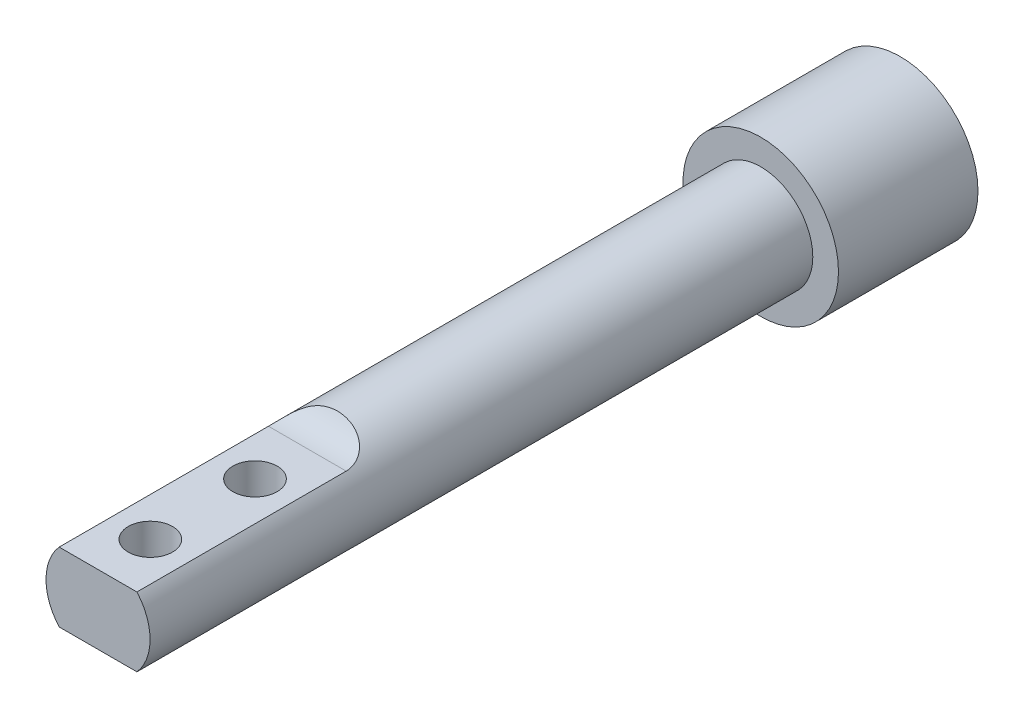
ISO-10303-21;
HEADER;
FILE_DESCRIPTION(('STEP AP214'),'2;1');
FILE_NAME('part.step','',(''),(''),'','','');
FILE_SCHEMA(('AUTOMOTIVE_DESIGN { 1 0 10303 214 1 1 1 1 }'));
ENDSEC;
DATA;
#1=APPLICATION_CONTEXT('core data for automotive mechanical design processes');
#2=APPLICATION_PROTOCOL_DEFINITION('international standard','automotive_design',2000,#1);
#3=PRODUCT_CONTEXT('',#1,'mechanical');
#4=PRODUCT('Part','Part','',(#3));
#5=PRODUCT_RELATED_PRODUCT_CATEGORY('part','',(#4));
#6=PRODUCT_DEFINITION_FORMATION('','',#4);
#7=PRODUCT_DEFINITION_CONTEXT('part definition',#1,'design');
#8=PRODUCT_DEFINITION('design','',#6,#7);
#9=PRODUCT_DEFINITION_SHAPE('','',#8);
#10=(LENGTH_UNIT() NAMED_UNIT(*) SI_UNIT(.MILLI.,.METRE.));
#11=(NAMED_UNIT(*) PLANE_ANGLE_UNIT() SI_UNIT($,.RADIAN.));
#12=(NAMED_UNIT(*) SI_UNIT($,.STERADIAN.) SOLID_ANGLE_UNIT());
#13=UNCERTAINTY_MEASURE_WITH_UNIT(LENGTH_MEASURE(1.E-05),#10,'distance_accuracy_value','');
#14=(GEOMETRIC_REPRESENTATION_CONTEXT(3) GLOBAL_UNCERTAINTY_ASSIGNED_CONTEXT((#13)) GLOBAL_UNIT_ASSIGNED_CONTEXT((#10,
#11,#12)) REPRESENTATION_CONTEXT('',''));
#15=CARTESIAN_POINT('',(0.,0.,0.));
#16=DIRECTION('',(0.,0.,1.));
#17=DIRECTION('',(1.,0.,0.));
#18=AXIS2_PLACEMENT_3D('',#15,#16,#17);
#19=CARTESIAN_POINT('',(0.,0.,-60.325));
#20=DIRECTION('',(0.,0.,1.));
#21=DIRECTION('',(1.,0.,0.));
#22=AXIS2_PLACEMENT_3D('',#19,#20,#21);
#23=CYLINDRICAL_SURFACE('',#22,4.7371);
#24=CARTESIAN_POINT('',(0.,0.,-60.325));
#25=DIRECTION('',(0.,0.,1.));
#26=DIRECTION('',(1.,0.,0.));
#27=AXIS2_PLACEMENT_3D('',#24,#25,#26);
#28=CIRCLE('',#27,4.7371);
#29=CARTESIAN_POINT('',(4.7371,0.,-60.325));
#30=VERTEX_POINT('',#29);
#31=EDGE_CURVE('E98',#30,#30,#28,.T.);
#32=ORIENTED_EDGE('',*,*,#31,.T.);
#33=EDGE_LOOP('',(#32));
#34=FACE_BOUND('',#33,.T.);
#35=CARTESIAN_POINT('',(0.,0.,0.));
#36=DIRECTION('',(0.,0.,1.));
#37=DIRECTION('',(1.,0.,0.));
#38=AXIS2_PLACEMENT_3D('',#35,#36,#37);
#39=CIRCLE('',#38,4.7371);
#40=CARTESIAN_POINT('',(3.53838045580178,-3.1496,0.));
#41=VERTEX_POINT('',#40);
#42=CARTESIAN_POINT('',(3.53838045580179,3.1496,0.));
#43=VERTEX_POINT('',#42);
#44=EDGE_CURVE('E89',#41,#43,#39,.T.);
#45=ORIENTED_EDGE('',*,*,#44,.F.);
#46=DIRECTION('',(0.,0.,1.));
#47=VECTOR('',#46,1.);
#48=CARTESIAN_POINT('',(3.53838045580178,-3.1496,-60.325));
#49=LINE('',#48,#47);
#50=CARTESIAN_POINT('',(3.53838045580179,-3.1496,-19.05));
#51=VERTEX_POINT('',#50);
#52=EDGE_CURVE('E51',#41,#51,#49,.F.);
#53=ORIENTED_EDGE('',*,*,#52,.T.);
#54=CARTESIAN_POINT('',(0.,-4.7371,-21.7996306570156));
#55=CARTESIAN_POINT('',(-0.110575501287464,-4.73709960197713,-21.7996313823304));
#56=CARTESIAN_POINT('',(-0.221175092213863,-4.73322359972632,-21.7974037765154));
#57=CARTESIAN_POINT('',(-0.441694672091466,-4.71775885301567,-21.7883873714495));
#58=CARTESIAN_POINT('',(-0.551614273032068,-4.70616605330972,-21.7815961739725));
#59=CARTESIAN_POINT('',(-0.770291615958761,-4.67535997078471,-21.7631082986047));
#60=CARTESIAN_POINT('',(-0.879045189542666,-4.65612521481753,-21.7513977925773));
#61=CARTESIAN_POINT('',(-1.09424801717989,-4.61029694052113,-21.7225499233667));
#62=CARTESIAN_POINT('',(-1.20069761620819,-4.58370453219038,-21.7054133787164));
#63=CARTESIAN_POINT('',(-1.41113812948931,-4.52336855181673,-21.6648652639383));
#64=CARTESIAN_POINT('',(-1.51510782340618,-4.48957831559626,-21.6414124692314));
#65=CARTESIAN_POINT('',(-1.71886891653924,-4.41558086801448,-21.5873942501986));
#66=CARTESIAN_POINT('',(-1.81865966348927,-4.37537265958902,-21.5568277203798));
#67=CARTESIAN_POINT('',(-2.0126661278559,-4.28958022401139,-21.4876919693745));
#68=CARTESIAN_POINT('',(-2.10689747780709,-4.24401226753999,-21.4491467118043));
#69=CARTESIAN_POINT('',(-2.28885449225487,-4.14871257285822,-21.3630628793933));
#70=CARTESIAN_POINT('',(-2.37658390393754,-4.09898326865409,-21.315529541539));
#71=CARTESIAN_POINT('',(-2.57304705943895,-3.97955030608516,-21.1926587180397));
#72=CARTESIAN_POINT('',(-2.6787459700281,-3.90881654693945,-21.1133667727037));
#73=CARTESIAN_POINT('',(-2.8734943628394,-3.76797268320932,-20.9360168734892));
#74=CARTESIAN_POINT('',(-2.96255379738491,-3.69786222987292,-20.8379702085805));
#75=CARTESIAN_POINT('',(-3.12246328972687,-3.56388916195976,-20.6232643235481));
#76=CARTESIAN_POINT('',(-3.19322136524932,-3.5000590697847,-20.5065156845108));
#77=CARTESIAN_POINT('',(-3.31498630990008,-3.38497531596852,-20.2574840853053));
#78=CARTESIAN_POINT('',(-3.36599387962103,-3.333721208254,-20.1252016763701));
#79=CARTESIAN_POINT('',(-3.44474766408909,-3.25219476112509,-19.861392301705));
#80=CARTESIAN_POINT('',(-3.4741240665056,-3.22049121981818,-19.7307893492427));
#81=CARTESIAN_POINT('',(-3.51682460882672,-3.17381110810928,-19.4640874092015));
#82=CARTESIAN_POINT('',(-3.53015107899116,-3.15883210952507,-19.3279892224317));
#83=CARTESIAN_POINT('',(-3.54087419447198,-3.14680564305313,-19.0578948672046));
#84=CARTESIAN_POINT('',(-3.53866984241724,-3.14930902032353,-18.9239340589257));
#85=CARTESIAN_POINT('',(-3.51922744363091,-3.17101941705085,-18.6584901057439));
#86=CARTESIAN_POINT('',(-3.50199110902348,-3.19022453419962,-18.5270066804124));
#87=CARTESIAN_POINT('',(-3.45221988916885,-3.24401318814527,-18.2704020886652));
#88=CARTESIAN_POINT('',(-3.41970352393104,-3.27857810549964,-18.1452734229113));
#89=CARTESIAN_POINT('',(-3.33908329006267,-3.3606437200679,-17.9046869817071));
#90=CARTESIAN_POINT('',(-3.29098165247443,-3.40814256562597,-17.7892278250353));
#91=CARTESIAN_POINT('',(-3.17880729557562,-3.51300592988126,-17.5699826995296));
#92=CARTESIAN_POINT('',(-3.11461497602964,-3.57044328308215,-17.4662929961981));
#93=CARTESIAN_POINT('',(-2.97117272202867,-3.69066226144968,-17.2735078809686));
#94=CARTESIAN_POINT('',(-2.89192065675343,-3.75344464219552,-17.1844145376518));
#95=CARTESIAN_POINT('',(-2.71518235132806,-3.88336696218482,-17.0170607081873));
#96=CARTESIAN_POINT('',(-2.61694573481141,-3.95055992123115,-16.9396383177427));
#97=CARTESIAN_POINT('',(-2.40765202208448,-4.08149355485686,-16.8009514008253));
#98=CARTESIAN_POINT('',(-2.2965883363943,-4.14523243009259,-16.7396952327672));
#99=CARTESIAN_POINT('',(-2.04760993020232,-4.2743132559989,-16.6239915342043));
#100=CARTESIAN_POINT('',(-1.90812376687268,-4.3385909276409,-16.571755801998));
#101=CARTESIAN_POINT('',(-1.61918237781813,-4.45450733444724,-16.4831496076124));
#102=CARTESIAN_POINT('',(-1.46972049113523,-4.50613751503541,-16.4467898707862));
#103=CARTESIAN_POINT('',(-1.22516144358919,-4.57692704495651,-16.3991009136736));
#104=CARTESIAN_POINT('',(-1.1321865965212,-4.60082007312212,-16.3835742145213));
#105=CARTESIAN_POINT('',(-0.944352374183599,-4.64301308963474,-16.3567637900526));
#106=CARTESIAN_POINT('',(-0.849492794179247,-4.66131246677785,-16.3454805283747));
#107=CARTESIAN_POINT('',(-0.65841656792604,-4.69211872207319,-16.3267751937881));
#108=CARTESIAN_POINT('',(-0.562199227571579,-4.70462251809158,-16.3193551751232));
#109=CARTESIAN_POINT('',(-0.368967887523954,-4.72370678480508,-16.3081232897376));
#110=CARTESIAN_POINT('',(-0.271953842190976,-4.73028691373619,-16.3043116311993));
#111=CARTESIAN_POINT('',(-0.0633002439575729,-4.73799038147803,-16.299850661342));
#112=CARTESIAN_POINT('',(0.0483875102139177,-4.73816653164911,-16.2997502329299));
#113=CARTESIAN_POINT('',(0.271416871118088,-4.73063438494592,-16.3041091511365));
#114=CARTESIAN_POINT('',(0.38275843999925,-4.72292525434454,-16.3085689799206));
#115=CARTESIAN_POINT('',(0.604447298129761,-4.69970126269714,-16.3222698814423));
#116=CARTESIAN_POINT('',(0.714793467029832,-4.68417850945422,-16.3315157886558));
#117=CARTESIAN_POINT('',(0.933579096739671,-4.64552317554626,-16.3552198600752));
#118=CARTESIAN_POINT('',(1.0420186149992,-4.62239082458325,-16.3696778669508));
#119=CARTESIAN_POINT('',(1.25844227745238,-4.56827567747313,-16.4048130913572));
#120=CARTESIAN_POINT('',(1.36636668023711,-4.53713502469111,-16.4256171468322));
#121=CARTESIAN_POINT('',(1.57835037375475,-4.46781400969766,-16.4741968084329));
#122=CARTESIAN_POINT('',(1.68240910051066,-4.42963262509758,-16.5019734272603));
#123=CARTESIAN_POINT('',(1.88528950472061,-4.34715451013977,-16.5654408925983));
#124=CARTESIAN_POINT('',(1.98412313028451,-4.30287264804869,-16.6011126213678));
#125=CARTESIAN_POINT('',(2.17552873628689,-4.20933987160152,-16.6814363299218));
#126=CARTESIAN_POINT('',(2.26810428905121,-4.16009183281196,-16.7260831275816));
#127=CARTESIAN_POINT('',(2.47581227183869,-4.04093753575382,-16.8421558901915));
#128=CARTESIAN_POINT('',(2.5880103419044,-3.96966953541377,-16.9175340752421));
#129=CARTESIAN_POINT('',(2.79588178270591,-3.8261095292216,-17.0877369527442));
#130=CARTESIAN_POINT('',(2.89156788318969,-3.75381835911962,-17.1825465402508));
#131=CARTESIAN_POINT('',(3.02111626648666,-3.64912601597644,-17.3393068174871));
#132=CARTESIAN_POINT('',(3.06208590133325,-3.61474048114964,-17.3941995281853));
#133=CARTESIAN_POINT('',(3.13905648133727,-3.54810105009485,-17.5085562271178));
#134=CARTESIAN_POINT('',(3.17505959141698,-3.51584622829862,-17.5680182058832));
#135=CARTESIAN_POINT('',(3.24198060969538,-3.45423703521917,-17.6911838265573));
#136=CARTESIAN_POINT('',(3.27289733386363,-3.42488333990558,-17.7548884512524));
#137=CARTESIAN_POINT('',(3.32958192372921,-3.36980085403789,-17.8860172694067));
#138=CARTESIAN_POINT('',(3.35535023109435,-3.34407175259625,-17.9534411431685));
#139=CARTESIAN_POINT('',(3.42040828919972,-3.27788443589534,-18.1470077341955));
#140=CARTESIAN_POINT('',(3.45393738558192,-3.24219171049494,-18.2768212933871));
#141=CARTESIAN_POINT('',(3.50456035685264,-3.18740974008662,-18.5429076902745));
#142=CARTESIAN_POINT('',(3.52165685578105,-3.1683178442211,-18.6791794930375));
#143=CARTESIAN_POINT('',(3.53948375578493,-3.14838694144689,-18.9496256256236));
#144=CARTESIAN_POINT('',(3.540728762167,-3.14697402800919,-19.0837238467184));
#145=CARTESIAN_POINT('',(3.52819646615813,-3.16101786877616,-19.3503117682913));
#146=CARTESIAN_POINT('',(3.5144208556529,-3.17647272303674,-19.4828016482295));
#147=CARTESIAN_POINT('',(3.4716414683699,-3.22316780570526,-19.7421456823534));
#148=CARTESIAN_POINT('',(3.44266869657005,-3.25437588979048,-19.8690107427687));
#149=CARTESIAN_POINT('',(3.36918826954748,-3.33038457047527,-20.1138256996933));
#150=CARTESIAN_POINT('',(3.32468298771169,-3.3751830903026,-20.2317769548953));
#151=CARTESIAN_POINT('',(3.21978142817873,-3.47539724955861,-20.4563711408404));
#152=CARTESIAN_POINT('',(3.15929872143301,-3.53087017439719,-20.5629480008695));
#153=CARTESIAN_POINT('',(3.02310875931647,-3.64814809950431,-20.7618949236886));
#154=CARTESIAN_POINT('',(2.94739972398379,-3.7099538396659,-20.8542633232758));
#155=CARTESIAN_POINT('',(2.77825750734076,-3.83837940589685,-21.0277577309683));
#156=CARTESIAN_POINT('',(2.68417281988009,-3.90509018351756,-21.1081777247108));
#157=CARTESIAN_POINT('',(2.48289375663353,-4.03606141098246,-21.252899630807));
#158=CARTESIAN_POINT('',(2.37569449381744,-4.10032093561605,-21.3171955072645));
#159=CARTESIAN_POINT('',(2.13578579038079,-4.23078274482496,-21.4386257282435));
#160=CARTESIAN_POINT('',(2.00157578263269,-4.29612761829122,-21.4937037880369));
#161=CARTESIAN_POINT('',(1.72280009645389,-4.41532978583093,-21.5879308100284));
#162=CARTESIAN_POINT('',(1.57822280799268,-4.46917392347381,-21.6270615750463));
#163=CARTESIAN_POINT('',(1.25220997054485,-4.57240073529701,-21.6986137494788));
#164=CARTESIAN_POINT('',(1.06917928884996,-4.61874551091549,-21.728135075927));
#165=CARTESIAN_POINT('',(0.697365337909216,-4.68930400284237,-21.7717920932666));
#166=CARTESIAN_POINT('',(0.508589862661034,-4.71354643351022,-21.7859477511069));
#167=CARTESIAN_POINT('',(0.265908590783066,-4.7299315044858,-21.7954795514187));
#168=CARTESIAN_POINT('',(0.212778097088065,-4.73261830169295,-21.797038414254));
#169=CARTESIAN_POINT('',(0.106433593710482,-4.7362026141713,-21.7991137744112));
#170=CARTESIAN_POINT('',(0.0532195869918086,-4.73710019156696,-21.7996303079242));
#171=CARTESIAN_POINT('',(0.,-4.7371,-21.7996306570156));
#172=B_SPLINE_CURVE_WITH_KNOTS('',3,(#54,#55,#56,#57,#58,#59,#60,#61,#62,#63,#64,#65,#66,#67,
#68,#69,#70,#71,#72,#73,#74,#75,#76,#77,#78,#79,#80,#81,#82,#83,#84,#85,#86,#87,#88,#89,#90,#91,
#92,#93,#94,#95,#96,#97,#98,#99,#100,#101,#102,#103,#104,#105,#106,#107,#108,#109,#110,#111,
#112,#113,#114,#115,#116,#117,#118,#119,#120,#121,#122,#123,#124,#125,#126,#127,#128,#129,#130,
#131,#132,#133,#134,#135,#136,#137,#138,#139,#140,#141,#142,#143,#144,#145,#146,#147,#148,#149,
#150,#151,#152,#153,#154,#155,#156,#157,#158,#159,#160,#161,#162,#163,#164,#165,#166,#167,#168,
#169,#170,#171),.UNSPECIFIED.,.T.,.F.,(4,2,2,2,2,2,2,2,2,2,2,2,2,2,2,2,2,2,2,2,2,2,2,2,2,2,2,2,
2,2,2,2,2,2,2,2,2,2,2,2,2,2,2,2,2,2,2,2,2,2,2,2,2,2,2,2,2,2,4),(0.,0.331677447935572,
0.663529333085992,0.996320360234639,1.32906120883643,1.66402873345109,1.99904834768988,
2.33307598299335,2.66690959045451,3.11454646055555,3.56191472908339,4.01148958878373,
4.46104849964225,4.87172891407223,5.2823496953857,5.68246039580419,6.08252553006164,
6.48210701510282,6.88163132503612,7.28421819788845,7.68686207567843,8.11111714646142,
8.53559114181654,9.020512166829,9.50576028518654,9.79724978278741,10.0887711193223,
10.3804473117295,10.6721403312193,11.0068246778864,11.341544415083,11.6766029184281,
12.0116513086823,12.3538917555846,12.6961819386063,13.0376521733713,13.3789258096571,
13.8353995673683,14.291519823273,14.5211711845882,14.7507221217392,14.9803264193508,
15.2099110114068,15.6238745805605,16.0377720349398,16.4381970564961,16.8385769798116,
17.2381432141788,17.6376484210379,18.0393606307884,18.4411198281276,18.8612256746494,
19.2814885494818,19.7570635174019,20.2331796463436,20.8043694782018,21.3748161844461,
21.5344568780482,21.6940920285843),.UNSPECIFIED.);
#173=CARTESIAN_POINT('',(-3.53838045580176,-3.1496,-19.05));
#174=VERTEX_POINT('',#173);
#175=EDGE_CURVE('E11',#51,#174,#172,.T.);
#176=ORIENTED_EDGE('',*,*,#175,.T.);
#177=DIRECTION('',(0.,0.,1.));
#178=VECTOR('',#177,1.);
#179=CARTESIAN_POINT('',(-3.53838045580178,-3.1496,-60.325));
#180=LINE('',#179,#178);
#181=CARTESIAN_POINT('',(-3.53838045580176,-3.1496,0.));
#182=VERTEX_POINT('',#181);
#183=EDGE_CURVE('E84',#174,#182,#180,.T.);
#184=ORIENTED_EDGE('',*,*,#183,.T.);
#185=CARTESIAN_POINT('',(-3.53838045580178,3.1496,0.));
#186=VERTEX_POINT('',#185);
#187=EDGE_CURVE('E102',#186,#182,#39,.T.);
#188=ORIENTED_EDGE('',*,*,#187,.F.);
#189=DIRECTION('',(0.,0.,1.));
#190=VECTOR('',#189,1.);
#191=CARTESIAN_POINT('',(-3.53838045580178,3.1496,-60.325));
#192=LINE('',#191,#190);
#193=CARTESIAN_POINT('',(-3.53838045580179,3.1496,-19.05));
#194=VERTEX_POINT('',#193);
#195=EDGE_CURVE('E59',#186,#194,#192,.F.);
#196=ORIENTED_EDGE('',*,*,#195,.T.);
#197=CARTESIAN_POINT('',(0.,4.7371,-21.7996306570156));
#198=CARTESIAN_POINT('',(0.110575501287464,4.73709960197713,-21.7996313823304));
#199=CARTESIAN_POINT('',(0.221175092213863,4.73322359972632,-21.7974037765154));
#200=CARTESIAN_POINT('',(0.441694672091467,4.71775885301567,-21.7883873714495));
#201=CARTESIAN_POINT('',(0.551614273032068,4.70616605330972,-21.7815961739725));
#202=CARTESIAN_POINT('',(0.770291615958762,4.67535997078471,-21.7631082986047));
#203=CARTESIAN_POINT('',(0.879045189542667,4.65612521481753,-21.7513977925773));
#204=CARTESIAN_POINT('',(1.09424801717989,4.61029694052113,-21.7225499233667));
#205=CARTESIAN_POINT('',(1.20069761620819,4.58370453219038,-21.7054133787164));
#206=CARTESIAN_POINT('',(1.41113812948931,4.52336855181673,-21.6648652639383));
#207=CARTESIAN_POINT('',(1.51510782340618,4.48957831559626,-21.6414124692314));
#208=CARTESIAN_POINT('',(1.71886891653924,4.41558086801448,-21.5873942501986));
#209=CARTESIAN_POINT('',(1.81865966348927,4.37537265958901,-21.5568277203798));
#210=CARTESIAN_POINT('',(2.01266612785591,4.28958022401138,-21.4876919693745));
#211=CARTESIAN_POINT('',(2.1068974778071,4.24401226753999,-21.4491467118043));
#212=CARTESIAN_POINT('',(2.28885449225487,4.14871257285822,-21.3630628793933));
#213=CARTESIAN_POINT('',(2.37658390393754,4.09898326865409,-21.315529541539));
#214=CARTESIAN_POINT('',(2.57304705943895,3.97955030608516,-21.1926587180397));
#215=CARTESIAN_POINT('',(2.6787459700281,3.90881654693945,-21.1133667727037));
#216=CARTESIAN_POINT('',(2.87349436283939,3.76797268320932,-20.9360168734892));
#217=CARTESIAN_POINT('',(2.96255379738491,3.69786222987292,-20.8379702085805));
#218=CARTESIAN_POINT('',(3.12246328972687,3.56388916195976,-20.6232643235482));
#219=CARTESIAN_POINT('',(3.19322136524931,3.50005906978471,-20.5065156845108));
#220=CARTESIAN_POINT('',(3.31498630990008,3.38497531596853,-20.2574840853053));
#221=CARTESIAN_POINT('',(3.36599387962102,3.33372120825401,-20.1252016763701));
#222=CARTESIAN_POINT('',(3.44474766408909,3.25219476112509,-19.861392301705));
#223=CARTESIAN_POINT('',(3.47412406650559,3.22049121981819,-19.7307893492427));
#224=CARTESIAN_POINT('',(3.51682460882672,3.17381110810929,-19.4640874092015));
#225=CARTESIAN_POINT('',(3.53015107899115,3.15883210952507,-19.3279892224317));
#226=CARTESIAN_POINT('',(3.54087419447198,3.14680564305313,-19.0578948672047));
#227=CARTESIAN_POINT('',(3.53866984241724,3.14930902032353,-18.9239340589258));
#228=CARTESIAN_POINT('',(3.51922744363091,3.17101941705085,-18.658490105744));
#229=CARTESIAN_POINT('',(3.50199110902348,3.19022453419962,-18.5270066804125));
#230=CARTESIAN_POINT('',(3.45221988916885,3.24401318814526,-18.2704020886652));
#231=CARTESIAN_POINT('',(3.41970352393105,3.27857810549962,-18.1452734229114));
#232=CARTESIAN_POINT('',(3.33908329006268,3.36064372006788,-17.9046869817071));
#233=CARTESIAN_POINT('',(3.29098165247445,3.40814256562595,-17.7892278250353));
#234=CARTESIAN_POINT('',(3.17880729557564,3.51300592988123,-17.5699826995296));
#235=CARTESIAN_POINT('',(3.11461497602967,3.57044328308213,-17.4662929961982));
#236=CARTESIAN_POINT('',(2.9711727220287,3.69066226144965,-17.2735078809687));
#237=CARTESIAN_POINT('',(2.89192065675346,3.7534446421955,-17.1844145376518));
#238=CARTESIAN_POINT('',(2.71518235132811,3.88336696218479,-17.0170607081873));
#239=CARTESIAN_POINT('',(2.61694573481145,3.95055992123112,-16.9396383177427));
#240=CARTESIAN_POINT('',(2.40765202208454,4.08149355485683,-16.8009514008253));
#241=CARTESIAN_POINT('',(2.29658833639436,4.14523243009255,-16.7396952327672));
#242=CARTESIAN_POINT('',(2.04760993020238,4.27431325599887,-16.6239915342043));
#243=CARTESIAN_POINT('',(1.90812376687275,4.33859092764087,-16.571755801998));
#244=CARTESIAN_POINT('',(1.61918237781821,4.45450733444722,-16.4831496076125));
#245=CARTESIAN_POINT('',(1.46972049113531,4.50613751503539,-16.4467898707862));
#246=CARTESIAN_POINT('',(1.22516144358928,4.57692704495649,-16.3991009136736));
#247=CARTESIAN_POINT('',(1.13218659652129,4.6008200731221,-16.3835742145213));
#248=CARTESIAN_POINT('',(0.944352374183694,4.64301308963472,-16.3567637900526));
#249=CARTESIAN_POINT('',(0.849492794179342,4.66131246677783,-16.3454805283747));
#250=CARTESIAN_POINT('',(0.658416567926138,4.69211872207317,-16.3267751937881));
#251=CARTESIAN_POINT('',(0.562199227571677,4.70462251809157,-16.3193551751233));
#252=CARTESIAN_POINT('',(0.368967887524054,4.72370678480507,-16.3081232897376));
#253=CARTESIAN_POINT('',(0.271953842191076,4.73028691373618,-16.3043116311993));
#254=CARTESIAN_POINT('',(0.0633002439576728,4.73799038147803,-16.299850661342));
#255=CARTESIAN_POINT('',(-0.0483875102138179,4.73816653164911,-16.2997502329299));
#256=CARTESIAN_POINT('',(-0.271416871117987,4.73063438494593,-16.3041091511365));
#257=CARTESIAN_POINT('',(-0.382758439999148,4.72292525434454,-16.3085689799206));
#258=CARTESIAN_POINT('',(-0.604447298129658,4.69970126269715,-16.3222698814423));
#259=CARTESIAN_POINT('',(-0.714793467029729,4.68417850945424,-16.3315157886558));
#260=CARTESIAN_POINT('',(-0.933579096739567,4.64552317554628,-16.3552198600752));
#261=CARTESIAN_POINT('',(-1.04201861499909,4.62239082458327,-16.3696778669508));
#262=CARTESIAN_POINT('',(-1.25844227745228,4.56827567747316,-16.4048130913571));
#263=CARTESIAN_POINT('',(-1.36636668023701,4.53713502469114,-16.4256171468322));
#264=CARTESIAN_POINT('',(-1.57835037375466,4.4678140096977,-16.4741968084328));
#265=CARTESIAN_POINT('',(-1.68240910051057,4.42963262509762,-16.5019734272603));
#266=CARTESIAN_POINT('',(-1.88528950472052,4.34715451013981,-16.5654408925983));
#267=CARTESIAN_POINT('',(-1.98412313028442,4.30287264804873,-16.6011126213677));
#268=CARTESIAN_POINT('',(-2.1755287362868,4.20933987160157,-16.6814363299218));
#269=CARTESIAN_POINT('',(-2.26810428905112,4.16009183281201,-16.7260831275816));
#270=CARTESIAN_POINT('',(-2.47581227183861,4.04093753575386,-16.8421558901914));
#271=CARTESIAN_POINT('',(-2.58801034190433,3.96966953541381,-16.917534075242));
#272=CARTESIAN_POINT('',(-2.79588178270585,3.82610952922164,-17.0877369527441));
#273=CARTESIAN_POINT('',(-2.89156788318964,3.75381835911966,-17.1825465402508));
#274=CARTESIAN_POINT('',(-3.02111626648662,3.64912601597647,-17.3393068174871));
#275=CARTESIAN_POINT('',(-3.06208590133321,3.61474048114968,-17.3941995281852));
#276=CARTESIAN_POINT('',(-3.13905648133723,3.54810105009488,-17.5085562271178));
#277=CARTESIAN_POINT('',(-3.17505959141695,3.51584622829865,-17.5680182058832));
#278=CARTESIAN_POINT('',(-3.24198060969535,3.4542370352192,-17.6911838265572));
#279=CARTESIAN_POINT('',(-3.27289733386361,3.4248833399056,-17.7548884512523));
#280=CARTESIAN_POINT('',(-3.32958192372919,3.36980085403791,-17.8860172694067));
#281=CARTESIAN_POINT('',(-3.35535023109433,3.34407175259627,-17.9534411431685));
#282=CARTESIAN_POINT('',(-3.42040828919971,3.27788443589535,-18.1470077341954));
#283=CARTESIAN_POINT('',(-3.45393738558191,3.24219171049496,-18.276821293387));
#284=CARTESIAN_POINT('',(-3.50456035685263,3.18740974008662,-18.5429076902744));
#285=CARTESIAN_POINT('',(-3.52165685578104,3.1683178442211,-18.6791794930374));
#286=CARTESIAN_POINT('',(-3.53948375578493,3.14838694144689,-18.9496256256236));
#287=CARTESIAN_POINT('',(-3.540728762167,3.14697402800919,-19.0837238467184));
#288=CARTESIAN_POINT('',(-3.52819646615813,3.16101786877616,-19.3503117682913));
#289=CARTESIAN_POINT('',(-3.51442085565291,3.17647272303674,-19.4828016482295));
#290=CARTESIAN_POINT('',(-3.4716414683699,3.22316780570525,-19.7421456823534));
#291=CARTESIAN_POINT('',(-3.44266869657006,3.25437588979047,-19.8690107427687));
#292=CARTESIAN_POINT('',(-3.36918826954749,3.33038457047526,-20.1138256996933));
#293=CARTESIAN_POINT('',(-3.3246829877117,3.37518309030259,-20.2317769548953));
#294=CARTESIAN_POINT('',(-3.21978142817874,3.47539724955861,-20.4563711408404));
#295=CARTESIAN_POINT('',(-3.15929872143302,3.53087017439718,-20.5629480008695));
#296=CARTESIAN_POINT('',(-3.02310875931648,3.6481480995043,-20.7618949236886));
#297=CARTESIAN_POINT('',(-2.9473997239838,3.7099538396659,-20.8542633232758));
#298=CARTESIAN_POINT('',(-2.77825750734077,3.83837940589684,-21.0277577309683));
#299=CARTESIAN_POINT('',(-2.6841728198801,3.90509018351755,-21.1081777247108));
#300=CARTESIAN_POINT('',(-2.48289375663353,4.03606141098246,-21.252899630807));
#301=CARTESIAN_POINT('',(-2.37569449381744,4.10032093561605,-21.3171955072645));
#302=CARTESIAN_POINT('',(-2.13578579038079,4.23078274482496,-21.4386257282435));
#303=CARTESIAN_POINT('',(-2.0015757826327,4.29612761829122,-21.4937037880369));
#304=CARTESIAN_POINT('',(-1.72280009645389,4.41532978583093,-21.5879308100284));
#305=CARTESIAN_POINT('',(-1.57822280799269,4.46917392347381,-21.6270615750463));
#306=CARTESIAN_POINT('',(-1.25220997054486,4.57240073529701,-21.6986137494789));
#307=CARTESIAN_POINT('',(-1.06917928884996,4.61874551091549,-21.728135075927));
#308=CARTESIAN_POINT('',(-0.697365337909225,4.68930400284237,-21.7717920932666));
#309=CARTESIAN_POINT('',(-0.508589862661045,4.71354643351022,-21.7859477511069));
#310=CARTESIAN_POINT('',(-0.265908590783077,4.7299315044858,-21.7954795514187));
#311=CARTESIAN_POINT('',(-0.212778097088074,4.73261830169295,-21.797038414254));
#312=CARTESIAN_POINT('',(-0.106433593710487,4.7362026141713,-21.7991137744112));
#313=CARTESIAN_POINT('',(-0.0532195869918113,4.73710019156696,-21.7996303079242));
#314=CARTESIAN_POINT('',(0.,4.7371,-21.7996306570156));
#315=B_SPLINE_CURVE_WITH_KNOTS('',3,(#197,#198,#199,#200,#201,#202,#203,#204,#205,#206,#207,
#208,#209,#210,#211,#212,#213,#214,#215,#216,#217,#218,#219,#220,#221,#222,#223,#224,#225,#226,
#227,#228,#229,#230,#231,#232,#233,#234,#235,#236,#237,#238,#239,#240,#241,#242,#243,#244,#245,
#246,#247,#248,#249,#250,#251,#252,#253,#254,#255,#256,#257,#258,#259,#260,#261,#262,#263,#264,
#265,#266,#267,#268,#269,#270,#271,#272,#273,#274,#275,#276,#277,#278,#279,#280,#281,#282,#283,
#284,#285,#286,#287,#288,#289,#290,#291,#292,#293,#294,#295,#296,#297,#298,#299,#300,#301,#302,
#303,#304,#305,#306,#307,#308,#309,#310,#311,#312,#313,#314),.UNSPECIFIED.,.T.,.F.,(4,2,2,2,2,2,
2,2,2,2,2,2,2,2,2,2,2,2,2,2,2,2,2,2,2,2,2,2,2,2,2,2,2,2,2,2,2,2,2,2,2,2,2,2,2,2,2,2,2,2,2,2,2,2,
2,2,2,2,4),(0.,0.331677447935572,0.663529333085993,0.996320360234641,1.32906120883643,
1.6640287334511,1.99904834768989,2.33307598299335,2.66690959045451,3.11454646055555,
3.56191472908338,4.01148958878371,4.46104849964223,4.87172891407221,5.28234969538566,
5.68246039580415,6.0825255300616,6.48210701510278,6.88163132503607,7.2842181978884,
7.68686207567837,8.11111714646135,8.53559114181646,9.02051216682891,9.50576028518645,
9.79724978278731,10.0887711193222,10.3804473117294,10.6721403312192,11.0068246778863,
11.3415444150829,11.676602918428,12.0116513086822,12.3538917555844,12.6961819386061,
13.0376521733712,13.378925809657,13.8353995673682,14.2915198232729,14.5211711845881,
14.7507221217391,14.9803264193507,15.2099110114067,15.6238745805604,16.0377720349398,
16.4381970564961,16.8385769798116,17.2381432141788,17.6376484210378,18.0393606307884,
18.4411198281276,18.8612256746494,19.2814885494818,19.7570635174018,20.2331796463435,
20.8043694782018,21.3748161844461,21.5344568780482,21.6940920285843),.UNSPECIFIED.);
#316=CARTESIAN_POINT('',(3.53838045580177,3.1496,-19.05));
#317=VERTEX_POINT('',#316);
#318=EDGE_CURVE('E112',#194,#317,#315,.T.);
#319=ORIENTED_EDGE('',*,*,#318,.T.);
#320=DIRECTION('',(0.,0.,1.));
#321=VECTOR('',#320,1.);
#322=CARTESIAN_POINT('',(3.53838045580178,3.1496,-60.325));
#323=LINE('',#322,#321);
#324=EDGE_CURVE('E92',#317,#43,#323,.T.);
#325=ORIENTED_EDGE('',*,*,#324,.T.);
#326=EDGE_LOOP('',(#45,#53,#176,#184,#188,#196,#319,#325));
#327=FACE_BOUND('',#326,.T.);
#328=ADVANCED_FACE('F34',(#34,#327),#23,.T.);
#329=CARTESIAN_POINT('',(0.,0.,0.));
#330=DIRECTION('',(0.,0.,1.));
#331=DIRECTION('',(1.,0.,0.));
#332=AXIS2_PLACEMENT_3D('',#329,#330,#331);
#333=PLANE('',#332);
#334=ORIENTED_EDGE('',*,*,#187,.T.);
#335=DIRECTION('',(1.,0.,0.));
#336=VECTOR('',#335,1.);
#337=CARTESIAN_POINT('',(0.,-3.1496,0.));
#338=LINE('',#337,#336);
#339=EDGE_CURVE('E43',#182,#41,#338,.T.);
#340=ORIENTED_EDGE('',*,*,#339,.T.);
#341=ORIENTED_EDGE('',*,*,#44,.T.);
#342=DIRECTION('',(-1.,0.,0.));
#343=VECTOR('',#342,1.);
#344=CARTESIAN_POINT('',(0.,3.1496,0.));
#345=LINE('',#344,#343);
#346=EDGE_CURVE('E110',#43,#186,#345,.T.);
#347=ORIENTED_EDGE('',*,*,#346,.T.);
#348=EDGE_LOOP('',(#334,#340,#341,#347));
#349=FACE_BOUND('',#348,.T.);
#350=ADVANCED_FACE('F144',(#349),#333,.T.);
#351=CARTESIAN_POINT('',(0.,0.,-73.025));
#352=DIRECTION('',(0.,0.,1.));
#353=DIRECTION('',(1.,0.,0.));
#354=AXIS2_PLACEMENT_3D('',#351,#352,#353);
#355=CYLINDRICAL_SURFACE('',#354,7.0739);
#356=CARTESIAN_POINT('',(0.,0.,-73.025));
#357=DIRECTION('',(0.,0.,1.));
#358=DIRECTION('',(1.,0.,0.));
#359=AXIS2_PLACEMENT_3D('',#356,#357,#358);
#360=CIRCLE('',#359,7.0739);
#361=CARTESIAN_POINT('',(7.0739,0.,-73.025));
#362=VERTEX_POINT('',#361);
#363=EDGE_CURVE('E105',#362,#362,#360,.T.);
#364=ORIENTED_EDGE('',*,*,#363,.T.);
#365=EDGE_LOOP('',(#364));
#366=FACE_BOUND('',#365,.T.);
#367=CARTESIAN_POINT('',(0.,0.,-60.325));
#368=DIRECTION('',(0.,0.,1.));
#369=DIRECTION('',(1.,0.,0.));
#370=AXIS2_PLACEMENT_3D('',#367,#368,#369);
#371=CIRCLE('',#370,7.0739);
#372=CARTESIAN_POINT('',(7.0739,0.,-60.325));
#373=VERTEX_POINT('',#372);
#374=EDGE_CURVE('E101',#373,#373,#371,.T.);
#375=ORIENTED_EDGE('',*,*,#374,.F.);
#376=EDGE_LOOP('',(#375));
#377=FACE_BOUND('',#376,.T.);
#378=ADVANCED_FACE('F36',(#366,#377),#355,.T.);
#379=CARTESIAN_POINT('',(0.,0.,-73.025));
#380=DIRECTION('',(0.,0.,1.));
#381=DIRECTION('',(1.,0.,0.));
#382=AXIS2_PLACEMENT_3D('',#379,#380,#381);
#383=PLANE('',#382);
#384=ORIENTED_EDGE('',*,*,#363,.F.);
#385=EDGE_LOOP('',(#384));
#386=FACE_BOUND('',#385,.T.);
#387=ADVANCED_FACE('F135',(#386),#383,.F.);
#388=CARTESIAN_POINT('',(0.,-15.7040013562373,-60.325));
#389=DIRECTION('',(0.,0.,1.));
#390=DIRECTION('',(1.,0.,0.));
#391=AXIS2_PLACEMENT_3D('',#388,#389,#390);
#392=PLANE('',#391);
#393=ORIENTED_EDGE('',*,*,#31,.F.);
#394=EDGE_LOOP('',(#393));
#395=FACE_BOUND('',#394,.T.);
#396=ORIENTED_EDGE('',*,*,#374,.T.);
#397=EDGE_LOOP('',(#396));
#398=FACE_BOUND('',#397,.T.);
#399=ADVANCED_FACE('F132',(#395,#398),#392,.T.);
#400=CARTESIAN_POINT('',(60.325,3.1496,0.));
#401=DIRECTION('',(0.,1.,0.));
#402=DIRECTION('',(0.,0.,1.));
#403=AXIS2_PLACEMENT_3D('',#400,#401,#402);
#404=PLANE('',#403);
#405=CARTESIAN_POINT('',(0.,3.1496,-4.7625));
#406=DIRECTION('',(0.,1.,0.));
#407=DIRECTION('',(0.,0.,1.));
#408=AXIS2_PLACEMENT_3D('',#405,#406,#407);
#409=CIRCLE('',#408,2.01929999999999);
#410=CARTESIAN_POINT('',(0.,3.1496,-2.74320000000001));
#411=VERTEX_POINT('',#410);
#412=EDGE_CURVE('E239',#411,#411,#409,.T.);
#413=ORIENTED_EDGE('',*,*,#412,.F.);
#414=EDGE_LOOP('',(#413));
#415=FACE_BOUND('',#414,.T.);
#416=CARTESIAN_POINT('',(0.,3.1496,-14.2875));
#417=DIRECTION('',(0.,1.,0.));
#418=DIRECTION('',(0.,0.,1.));
#419=AXIS2_PLACEMENT_3D('',#416,#417,#418);
#420=CIRCLE('',#419,2.01929999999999);
#421=CARTESIAN_POINT('',(0.,3.1496,-12.2682));
#422=VERTEX_POINT('',#421);
#423=EDGE_CURVE('E241',#422,#422,#420,.T.);
#424=ORIENTED_EDGE('',*,*,#423,.F.);
#425=EDGE_LOOP('',(#424));
#426=FACE_BOUND('',#425,.T.);
#427=ORIENTED_EDGE('',*,*,#346,.F.);
#428=ORIENTED_EDGE('',*,*,#324,.F.);
#429=DIRECTION('',(-1.,0.,0.));
#430=VECTOR('',#429,1.);
#431=CARTESIAN_POINT('',(60.325,3.1496,-19.05));
#432=LINE('',#431,#430);
#433=EDGE_CURVE('E90',#317,#194,#432,.T.);
#434=ORIENTED_EDGE('',*,*,#433,.T.);
#435=ORIENTED_EDGE('',*,*,#195,.F.);
#436=EDGE_LOOP('',(#427,#428,#434,#435));
#437=FACE_BOUND('',#436,.T.);
#438=ADVANCED_FACE('F127',(#415,#426,#437),#404,.T.);
#439=CARTESIAN_POINT('',(60.325,6.3246,-19.05));
#440=DIRECTION('',(-1.,0.,0.));
#441=DIRECTION('',(0.,0.,1.));
#442=AXIS2_PLACEMENT_3D('',#439,#440,#441);
#443=CYLINDRICAL_SURFACE('',#442,3.175);
#444=ORIENTED_EDGE('',*,*,#433,.F.);
#445=ORIENTED_EDGE('',*,*,#318,.F.);
#446=EDGE_LOOP('',(#444,#445));
#447=FACE_BOUND('',#446,.T.);
#448=ADVANCED_FACE('F122',(#447),#443,.F.);
#449=CARTESIAN_POINT('',(60.325,-6.3246,-19.05));
#450=DIRECTION('',(-1.,0.,0.));
#451=DIRECTION('',(0.,0.,1.));
#452=AXIS2_PLACEMENT_3D('',#449,#450,#451);
#453=CYLINDRICAL_SURFACE('',#452,3.175);
#454=DIRECTION('',(-1.,0.,0.));
#455=VECTOR('',#454,1.);
#456=CARTESIAN_POINT('',(60.325,-3.1496,-19.05));
#457=LINE('',#456,#455);
#458=EDGE_CURVE('E80',#51,#174,#457,.T.);
#459=ORIENTED_EDGE('',*,*,#458,.T.);
#460=ORIENTED_EDGE('',*,*,#175,.F.);
#461=EDGE_LOOP('',(#459,#460));
#462=FACE_BOUND('',#461,.T.);
#463=ADVANCED_FACE('F79',(#462),#453,.F.);
#464=CARTESIAN_POINT('',(60.325,-3.1496,-19.05));
#465=DIRECTION('',(0.,-1.,0.));
#466=DIRECTION('',(0.,0.,-1.));
#467=AXIS2_PLACEMENT_3D('',#464,#465,#466);
#468=PLANE('',#467);
#469=CARTESIAN_POINT('',(0.,-3.1496,-4.7625));
#470=DIRECTION('',(0.,-1.,0.));
#471=DIRECTION('',(0.,0.,-1.));
#472=AXIS2_PLACEMENT_3D('',#469,#470,#471);
#473=CIRCLE('',#472,2.01929999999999);
#474=CARTESIAN_POINT('',(0.,-3.1496,-6.78179999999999));
#475=VERTEX_POINT('',#474);
#476=EDGE_CURVE('E38',#475,#475,#473,.T.);
#477=ORIENTED_EDGE('',*,*,#476,.F.);
#478=EDGE_LOOP('',(#477));
#479=FACE_BOUND('',#478,.T.);
#480=CARTESIAN_POINT('',(0.,-3.1496,-14.2875));
#481=DIRECTION('',(0.,-1.,0.));
#482=DIRECTION('',(0.,0.,-1.));
#483=AXIS2_PLACEMENT_3D('',#480,#481,#482);
#484=CIRCLE('',#483,2.01929999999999);
#485=CARTESIAN_POINT('',(0.,-3.1496,-16.3068));
#486=VERTEX_POINT('',#485);
#487=EDGE_CURVE('E85',#486,#486,#484,.T.);
#488=ORIENTED_EDGE('',*,*,#487,.F.);
#489=EDGE_LOOP('',(#488));
#490=FACE_BOUND('',#489,.T.);
#491=ORIENTED_EDGE('',*,*,#339,.F.);
#492=ORIENTED_EDGE('',*,*,#183,.F.);
#493=ORIENTED_EDGE('',*,*,#458,.F.);
#494=ORIENTED_EDGE('',*,*,#52,.F.);
#495=EDGE_LOOP('',(#491,#492,#493,#494));
#496=FACE_BOUND('',#495,.T.);
#497=ADVANCED_FACE('F83',(#479,#490,#496),#468,.T.);
#498=CARTESIAN_POINT('',(0.,3.1496,-14.2875));
#499=DIRECTION('',(0.,1.,0.));
#500=DIRECTION('',(0.,0.,1.));
#501=AXIS2_PLACEMENT_3D('',#498,#499,#500);
#502=CYLINDRICAL_SURFACE('',#501,2.01929999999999);
#503=ORIENTED_EDGE('',*,*,#487,.T.);
#504=EDGE_LOOP('',(#503));
#505=FACE_BOUND('',#504,.T.);
#506=ORIENTED_EDGE('',*,*,#423,.T.);
#507=EDGE_LOOP('',(#506));
#508=FACE_BOUND('',#507,.T.);
#509=ADVANCED_FACE('F205',(#505,#508),#502,.F.);
#510=CARTESIAN_POINT('',(0.,3.1496,-4.7625));
#511=DIRECTION('',(0.,1.,0.));
#512=DIRECTION('',(0.,0.,1.));
#513=AXIS2_PLACEMENT_3D('',#510,#511,#512);
#514=CYLINDRICAL_SURFACE('',#513,2.01929999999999);
#515=ORIENTED_EDGE('',*,*,#476,.T.);
#516=EDGE_LOOP('',(#515));
#517=FACE_BOUND('',#516,.T.);
#518=ORIENTED_EDGE('',*,*,#412,.T.);
#519=EDGE_LOOP('',(#518));
#520=FACE_BOUND('',#519,.T.);
#521=ADVANCED_FACE('F213',(#517,#520),#514,.F.);
#522=CLOSED_SHELL('',(#328,#350,#378,#387,#399,#438,#448,#463,#497,#509,#521));
#523=MANIFOLD_SOLID_BREP('B2',#522);
#524=ADVANCED_BREP_SHAPE_REPRESENTATION('',(#18,#523),#14);
#525=SHAPE_DEFINITION_REPRESENTATION(#9,#524);
ENDSEC;
END-ISO-10303-21;
